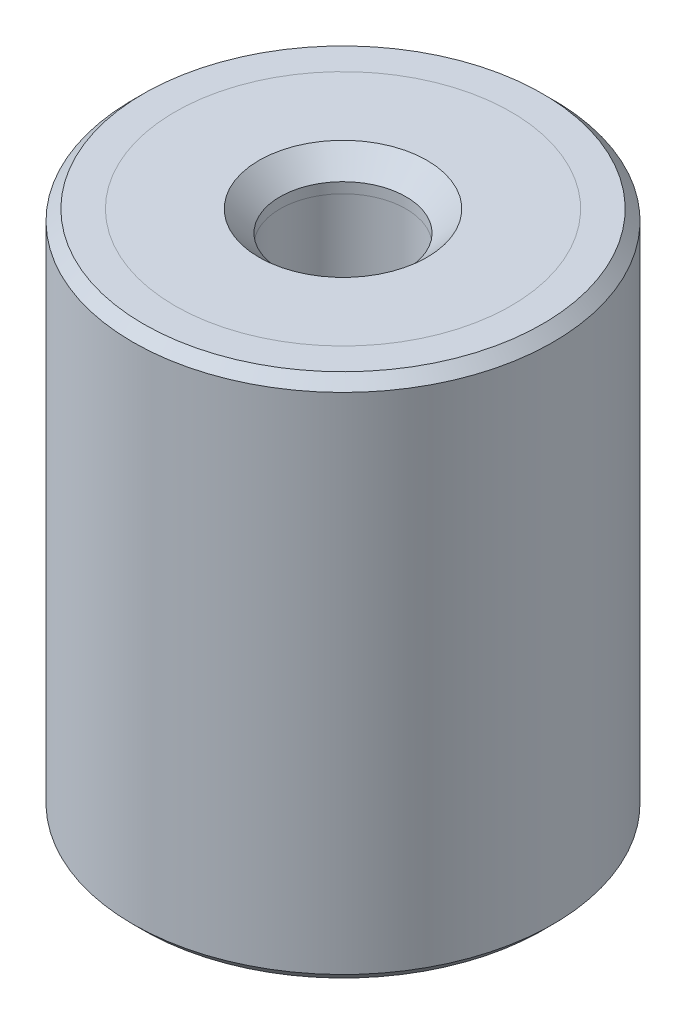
ISO-10303-21;
HEADER;
FILE_DESCRIPTION(('STEP AP214'),'2;1');
FILE_NAME('part.step','',(''),(''),'','','');
FILE_SCHEMA(('AUTOMOTIVE_DESIGN { 1 0 10303 214 1 1 1 1 }'));
ENDSEC;
DATA;
#1=APPLICATION_CONTEXT('core data for automotive mechanical design processes');
#2=APPLICATION_PROTOCOL_DEFINITION('international standard','automotive_design',2000,#1);
#3=PRODUCT_CONTEXT('',#1,'mechanical');
#4=PRODUCT('Part','Part','',(#3));
#5=PRODUCT_RELATED_PRODUCT_CATEGORY('part','',(#4));
#6=PRODUCT_DEFINITION_FORMATION('','',#4);
#7=PRODUCT_DEFINITION_CONTEXT('part definition',#1,'design');
#8=PRODUCT_DEFINITION('design','',#6,#7);
#9=PRODUCT_DEFINITION_SHAPE('','',#8);
#10=(LENGTH_UNIT() NAMED_UNIT(*) SI_UNIT(.MILLI.,.METRE.));
#11=(NAMED_UNIT(*) PLANE_ANGLE_UNIT() SI_UNIT($,.RADIAN.));
#12=(NAMED_UNIT(*) SI_UNIT($,.STERADIAN.) SOLID_ANGLE_UNIT());
#13=UNCERTAINTY_MEASURE_WITH_UNIT(LENGTH_MEASURE(1.E-05),#10,'distance_accuracy_value','');
#14=(GEOMETRIC_REPRESENTATION_CONTEXT(3) GLOBAL_UNCERTAINTY_ASSIGNED_CONTEXT((#13)) GLOBAL_UNIT_ASSIGNED_CONTEXT((#10,
#11,#12)) REPRESENTATION_CONTEXT('',''));
#15=CARTESIAN_POINT('',(0.,0.,0.));
#16=DIRECTION('',(0.,0.,1.));
#17=DIRECTION('',(1.,0.,0.));
#18=AXIS2_PLACEMENT_3D('',#15,#16,#17);
#19=CARTESIAN_POINT('',(0.,46.0340428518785,0.));
#20=DIRECTION('',(0.,1.,0.));
#21=DIRECTION('',(0.,0.,1.));
#22=AXIS2_PLACEMENT_3D('',#19,#20,#21);
#23=CYLINDRICAL_SURFACE('',#22,3.);
#24=CARTESIAN_POINT('',(0.,-22.5,0.));
#25=DIRECTION('',(0.,-1.,0.));
#26=DIRECTION('',(0.,0.,-1.));
#27=AXIS2_PLACEMENT_3D('',#24,#25,#26);
#28=CIRCLE('',#27,3.);
#29=CARTESIAN_POINT('',(0.,-22.5,-3.));
#30=VERTEX_POINT('',#29);
#31=EDGE_CURVE('P0_E10',#30,#30,#28,.T.);
#32=ORIENTED_EDGE('',*,*,#31,.T.);
#33=EDGE_LOOP('',(#32));
#34=FACE_BOUND('',#33,.T.);
#35=CARTESIAN_POINT('',(0.,-22.,0.));
#36=DIRECTION('',(0.,1.,0.));
#37=DIRECTION('',(0.,0.,1.));
#38=AXIS2_PLACEMENT_3D('',#35,#36,#37);
#39=CIRCLE('',#38,3.);
#40=CARTESIAN_POINT('',(0.,-22.,3.));
#41=VERTEX_POINT('',#40);
#42=EDGE_CURVE('P0_E25',#41,#41,#39,.T.);
#43=ORIENTED_EDGE('',*,*,#42,.T.);
#44=EDGE_LOOP('',(#43));
#45=FACE_BOUND('',#44,.T.);
#46=ADVANCED_FACE('P0_F14',(#34,#45),#23,.F.);
#47=CARTESIAN_POINT('',(0.,-22.,3.));
#48=DIRECTION('',(0.,1.,0.));
#49=DIRECTION('',(0.,0.,1.));
#50=AXIS2_PLACEMENT_3D('',#47,#48,#49);
#51=PLANE('',#50);
#52=CARTESIAN_POINT('',(0.,-22.,0.));
#53=DIRECTION('',(0.,1.,0.));
#54=DIRECTION('',(0.,0.,1.));
#55=AXIS2_PLACEMENT_3D('',#52,#53,#54);
#56=CIRCLE('',#55,8.);
#57=CARTESIAN_POINT('',(0.,-22.,8.));
#58=VERTEX_POINT('',#57);
#59=EDGE_CURVE('P0_E29',#58,#58,#56,.T.);
#60=ORIENTED_EDGE('',*,*,#59,.T.);
#61=EDGE_LOOP('',(#60));
#62=FACE_BOUND('',#61,.T.);
#63=ORIENTED_EDGE('',*,*,#42,.F.);
#64=EDGE_LOOP('',(#63));
#65=FACE_BOUND('',#64,.T.);
#66=ADVANCED_FACE('P0_F50',(#62,#65),#51,.T.);
#67=CARTESIAN_POINT('',(0.,46.0340428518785,0.));
#68=DIRECTION('',(0.,1.,0.));
#69=DIRECTION('',(0.,0.,1.));
#70=AXIS2_PLACEMENT_3D('',#67,#68,#69);
#71=CYLINDRICAL_SURFACE('',#70,8.);
#72=CARTESIAN_POINT('',(0.,-23.5,0.));
#73=DIRECTION('',(0.,1.,0.));
#74=DIRECTION('',(0.,0.,1.));
#75=AXIS2_PLACEMENT_3D('',#72,#73,#74);
#76=CIRCLE('',#75,8.);
#77=CARTESIAN_POINT('',(0.,-23.5,8.));
#78=VERTEX_POINT('',#77);
#79=EDGE_CURVE('P0_E34',#78,#78,#76,.T.);
#80=ORIENTED_EDGE('',*,*,#79,.T.);
#81=EDGE_LOOP('',(#80));
#82=FACE_BOUND('',#81,.T.);
#83=ORIENTED_EDGE('',*,*,#59,.F.);
#84=EDGE_LOOP('',(#83));
#85=FACE_BOUND('',#84,.T.);
#86=ADVANCED_FACE('P0_F38',(#82,#85),#71,.T.);
#87=CARTESIAN_POINT('',(0.,-23.5,8.));
#88=DIRECTION('',(0.,-1.,0.));
#89=DIRECTION('',(0.,0.,-1.));
#90=AXIS2_PLACEMENT_3D('',#87,#88,#89);
#91=PLANE('',#90);
#92=CARTESIAN_POINT('',(0.,-23.5,0.));
#93=DIRECTION('',(0.,-1.,0.));
#94=DIRECTION('',(0.,0.,-1.));
#95=AXIS2_PLACEMENT_3D('',#92,#93,#94);
#96=CIRCLE('',#95,4.);
#97=CARTESIAN_POINT('',(0.,-23.5,-4.));
#98=VERTEX_POINT('',#97);
#99=EDGE_CURVE('P0_E21',#98,#98,#96,.F.);
#100=ORIENTED_EDGE('',*,*,#99,.T.);
#101=EDGE_LOOP('',(#100));
#102=FACE_BOUND('',#101,.T.);
#103=ORIENTED_EDGE('',*,*,#79,.F.);
#104=EDGE_LOOP('',(#103));
#105=FACE_BOUND('',#104,.T.);
#106=ADVANCED_FACE('P0_F41',(#102,#105),#91,.T.);
#107=CARTESIAN_POINT('',(0.,-23.5,0.));
#108=DIRECTION('',(0.,-1.,0.));
#109=DIRECTION('',(0.,0.,-1.));
#110=AXIS2_PLACEMENT_3D('',#107,#108,#109);
#111=CONICAL_SURFACE('',#110,4.,0.785398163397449);
#112=ORIENTED_EDGE('',*,*,#31,.F.);
#113=EDGE_LOOP('',(#112));
#114=FACE_BOUND('',#113,.T.);
#115=ORIENTED_EDGE('',*,*,#99,.F.);
#116=EDGE_LOOP('',(#115));
#117=FACE_BOUND('',#116,.T.);
#118=ADVANCED_FACE('P0_F16',(#114,#117),#111,.F.);
#119=CLOSED_SHELL('',(#46,#66,#86,#106,#118));
#120=MANIFOLD_SOLID_BREP('P0_B1',#119);
#121=CARTESIAN_POINT('',(0.,69.5340428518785,0.));
#122=DIRECTION('',(0.,1.,0.));
#123=DIRECTION('',(0.,0.,1.));
#124=AXIS2_PLACEMENT_3D('',#121,#122,#123);
#125=CYLINDRICAL_SURFACE('',#124,3.);
#126=CARTESIAN_POINT('',(0.,0.5,0.));
#127=DIRECTION('',(0.,1.,0.));
#128=DIRECTION('',(0.,0.,1.));
#129=AXIS2_PLACEMENT_3D('',#126,#127,#128);
#130=CIRCLE('',#129,3.);
#131=CARTESIAN_POINT('',(0.,0.5,3.));
#132=VERTEX_POINT('',#131);
#133=EDGE_CURVE('P1_E21',#132,#132,#130,.T.);
#134=ORIENTED_EDGE('',*,*,#133,.T.);
#135=EDGE_LOOP('',(#134));
#136=FACE_BOUND('',#135,.T.);
#137=CARTESIAN_POINT('',(0.,0.,0.));
#138=DIRECTION('',(0.,1.,0.));
#139=DIRECTION('',(0.,0.,1.));
#140=AXIS2_PLACEMENT_3D('',#137,#138,#139);
#141=CIRCLE('',#140,3.);
#142=CARTESIAN_POINT('',(0.,0.,3.));
#143=VERTEX_POINT('',#142);
#144=EDGE_CURVE('P1_E34',#143,#143,#141,.T.);
#145=ORIENTED_EDGE('',*,*,#144,.F.);
#146=EDGE_LOOP('',(#145));
#147=FACE_BOUND('',#146,.T.);
#148=ADVANCED_FACE('P1_F14',(#136,#147),#125,.F.);
#149=CARTESIAN_POINT('',(0.,1.5,3.));
#150=DIRECTION('',(0.,1.,0.));
#151=DIRECTION('',(0.,0.,1.));
#152=AXIS2_PLACEMENT_3D('',#149,#150,#151);
#153=PLANE('',#152);
#154=CARTESIAN_POINT('',(0.,1.5,0.));
#155=DIRECTION('',(0.,1.,0.));
#156=DIRECTION('',(0.,0.,1.));
#157=AXIS2_PLACEMENT_3D('',#154,#155,#156);
#158=CIRCLE('',#157,4.);
#159=CARTESIAN_POINT('',(0.,1.5,4.));
#160=VERTEX_POINT('',#159);
#161=EDGE_CURVE('P1_E10',#160,#160,#158,.F.);
#162=ORIENTED_EDGE('',*,*,#161,.T.);
#163=EDGE_LOOP('',(#162));
#164=FACE_BOUND('',#163,.T.);
#165=CARTESIAN_POINT('',(0.,1.5,0.));
#166=DIRECTION('',(0.,1.,0.));
#167=DIRECTION('',(0.,0.,1.));
#168=AXIS2_PLACEMENT_3D('',#165,#166,#167);
#169=CIRCLE('',#168,8.);
#170=CARTESIAN_POINT('',(0.,1.5,8.));
#171=VERTEX_POINT('',#170);
#172=EDGE_CURVE('P1_E25',#171,#171,#169,.T.);
#173=ORIENTED_EDGE('',*,*,#172,.T.);
#174=EDGE_LOOP('',(#173));
#175=FACE_BOUND('',#174,.T.);
#176=ADVANCED_FACE('P1_F42',(#164,#175),#153,.T.);
#177=CARTESIAN_POINT('',(0.,69.5340428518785,0.));
#178=DIRECTION('',(0.,1.,0.));
#179=DIRECTION('',(0.,0.,1.));
#180=AXIS2_PLACEMENT_3D('',#177,#178,#179);
#181=CYLINDRICAL_SURFACE('',#180,8.);
#182=CARTESIAN_POINT('',(0.,0.,0.));
#183=DIRECTION('',(0.,1.,0.));
#184=DIRECTION('',(0.,0.,1.));
#185=AXIS2_PLACEMENT_3D('',#182,#183,#184);
#186=CIRCLE('',#185,8.);
#187=CARTESIAN_POINT('',(0.,0.,8.));
#188=VERTEX_POINT('',#187);
#189=EDGE_CURVE('P1_E29',#188,#188,#186,.T.);
#190=ORIENTED_EDGE('',*,*,#189,.T.);
#191=EDGE_LOOP('',(#190));
#192=FACE_BOUND('',#191,.T.);
#193=ORIENTED_EDGE('',*,*,#172,.F.);
#194=EDGE_LOOP('',(#193));
#195=FACE_BOUND('',#194,.T.);
#196=ADVANCED_FACE('P1_F47',(#192,#195),#181,.T.);
#197=CARTESIAN_POINT('',(0.,0.,8.));
#198=DIRECTION('',(0.,-1.,0.));
#199=DIRECTION('',(0.,0.,-1.));
#200=AXIS2_PLACEMENT_3D('',#197,#198,#199);
#201=PLANE('',#200);
#202=ORIENTED_EDGE('',*,*,#144,.T.);
#203=EDGE_LOOP('',(#202));
#204=FACE_BOUND('',#203,.T.);
#205=ORIENTED_EDGE('',*,*,#189,.F.);
#206=EDGE_LOOP('',(#205));
#207=FACE_BOUND('',#206,.T.);
#208=ADVANCED_FACE('P1_F38',(#204,#207),#201,.T.);
#209=CARTESIAN_POINT('',(0.,0.5,0.));
#210=DIRECTION('',(0.,1.,0.));
#211=DIRECTION('',(0.,0.,1.));
#212=AXIS2_PLACEMENT_3D('',#209,#210,#211);
#213=CONICAL_SURFACE('',#212,3.,0.78539816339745);
#214=ORIENTED_EDGE('',*,*,#161,.F.);
#215=EDGE_LOOP('',(#214));
#216=FACE_BOUND('',#215,.T.);
#217=ORIENTED_EDGE('',*,*,#133,.F.);
#218=EDGE_LOOP('',(#217));
#219=FACE_BOUND('',#218,.T.);
#220=ADVANCED_FACE('P1_F16',(#216,#219),#213,.F.);
#221=CLOSED_SHELL('',(#148,#176,#196,#208,#220));
#222=MANIFOLD_SOLID_BREP('P1_B1',#221);
#223=CARTESIAN_POINT('',(0.,0.,0.));
#224=DIRECTION('',(0.,1.,0.));
#225=DIRECTION('',(0.,0.,1.));
#226=AXIS2_PLACEMENT_3D('',#223,#224,#225);
#227=PLANE('',#226);
#228=CARTESIAN_POINT('',(0.,0.,0.));
#229=DIRECTION('',(0.,1.,0.));
#230=DIRECTION('',(0.,0.,1.));
#231=AXIS2_PLACEMENT_3D('',#228,#229,#230);
#232=CIRCLE('',#231,3.);
#233=CARTESIAN_POINT('',(0.,0.,3.));
#234=VERTEX_POINT('',#233);
#235=EDGE_CURVE('P2_E46',#234,#234,#232,.T.);
#236=ORIENTED_EDGE('',*,*,#235,.F.);
#237=EDGE_LOOP('',(#236));
#238=FACE_BOUND('',#237,.T.);
#239=CARTESIAN_POINT('',(0.,0.,0.));
#240=DIRECTION('',(0.,1.,0.));
#241=DIRECTION('',(0.,0.,1.));
#242=AXIS2_PLACEMENT_3D('',#239,#240,#241);
#243=CIRCLE('',#242,8.);
#244=CARTESIAN_POINT('',(0.,0.,8.));
#245=VERTEX_POINT('',#244);
#246=EDGE_CURVE('P2_E33',#245,#245,#243,.T.);
#247=ORIENTED_EDGE('',*,*,#246,.T.);
#248=EDGE_LOOP('',(#247));
#249=FACE_BOUND('',#248,.T.);
#250=ADVANCED_FACE('P2_F13',(#238,#249),#227,.T.);
#251=CARTESIAN_POINT('',(0.,65.5134936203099,0.));
#252=DIRECTION('',(0.,1.,0.));
#253=DIRECTION('',(0.,0.,1.));
#254=AXIS2_PLACEMENT_3D('',#251,#252,#253);
#255=CYLINDRICAL_SURFACE('',#254,8.);
#256=CARTESIAN_POINT('',(0.,1.5,0.));
#257=DIRECTION('',(0.,1.,0.));
#258=DIRECTION('',(0.,0.,1.));
#259=AXIS2_PLACEMENT_3D('',#256,#257,#258);
#260=CIRCLE('',#259,8.);
#261=CARTESIAN_POINT('',(0.,1.5,8.));
#262=VERTEX_POINT('',#261);
#263=EDGE_CURVE('P2_E36',#262,#262,#260,.T.);
#264=ORIENTED_EDGE('',*,*,#263,.T.);
#265=EDGE_LOOP('',(#264));
#266=FACE_BOUND('',#265,.T.);
#267=ORIENTED_EDGE('',*,*,#246,.F.);
#268=EDGE_LOOP('',(#267));
#269=FACE_BOUND('',#268,.T.);
#270=ADVANCED_FACE('P2_F92',(#266,#269),#255,.F.);
#271=CARTESIAN_POINT('',(0.,1.5,8.));
#272=DIRECTION('',(0.,1.,0.));
#273=DIRECTION('',(0.,0.,1.));
#274=AXIS2_PLACEMENT_3D('',#271,#272,#273);
#275=PLANE('',#274);
#276=CARTESIAN_POINT('',(0.,1.5,0.));
#277=DIRECTION('',(0.,1.,0.));
#278=DIRECTION('',(0.,0.,1.));
#279=AXIS2_PLACEMENT_3D('',#276,#277,#278);
#280=CIRCLE('',#279,9.5);
#281=CARTESIAN_POINT('',(0.,1.5,9.5));
#282=VERTEX_POINT('',#281);
#283=EDGE_CURVE('P2_E9',#282,#282,#280,.T.);
#284=ORIENTED_EDGE('',*,*,#283,.T.);
#285=EDGE_LOOP('',(#284));
#286=FACE_BOUND('',#285,.T.);
#287=ORIENTED_EDGE('',*,*,#263,.F.);
#288=EDGE_LOOP('',(#287));
#289=FACE_BOUND('',#288,.T.);
#290=ADVANCED_FACE('P2_F88',(#286,#289),#275,.T.);
#291=CARTESIAN_POINT('',(0.,65.5134936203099,0.));
#292=DIRECTION('',(0.,1.,0.));
#293=DIRECTION('',(0.,0.,1.));
#294=AXIS2_PLACEMENT_3D('',#291,#292,#293);
#295=CYLINDRICAL_SURFACE('',#294,10.);
#296=CARTESIAN_POINT('',(0.,-23.,0.));
#297=DIRECTION('',(0.,-1.,0.));
#298=DIRECTION('',(0.,0.,-1.));
#299=AXIS2_PLACEMENT_3D('',#296,#297,#298);
#300=CIRCLE('',#299,10.);
#301=CARTESIAN_POINT('',(0.,-23.,-10.));
#302=VERTEX_POINT('',#301);
#303=EDGE_CURVE('P2_E24',#302,#302,#300,.F.);
#304=ORIENTED_EDGE('',*,*,#303,.T.);
#305=EDGE_LOOP('',(#304));
#306=FACE_BOUND('',#305,.T.);
#307=CARTESIAN_POINT('',(0.,1.,0.));
#308=DIRECTION('',(0.,1.,0.));
#309=DIRECTION('',(0.,0.,1.));
#310=AXIS2_PLACEMENT_3D('',#307,#308,#309);
#311=CIRCLE('',#310,10.);
#312=CARTESIAN_POINT('',(0.,1.,10.));
#313=VERTEX_POINT('',#312);
#314=EDGE_CURVE('P2_E28',#313,#313,#311,.F.);
#315=ORIENTED_EDGE('',*,*,#314,.T.);
#316=EDGE_LOOP('',(#315));
#317=FACE_BOUND('',#316,.T.);
#318=ADVANCED_FACE('P2_F82',(#306,#317),#295,.T.);
#319=CARTESIAN_POINT('',(0.,-23.5,9.99999999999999));
#320=DIRECTION('',(0.,-1.,0.));
#321=DIRECTION('',(0.,0.,-1.));
#322=AXIS2_PLACEMENT_3D('',#319,#320,#321);
#323=PLANE('',#322);
#324=CARTESIAN_POINT('',(0.,-23.5,0.));
#325=DIRECTION('',(0.,-1.,0.));
#326=DIRECTION('',(0.,0.,-1.));
#327=AXIS2_PLACEMENT_3D('',#324,#325,#326);
#328=CIRCLE('',#327,9.5);
#329=CARTESIAN_POINT('',(0.,-23.5,-9.5));
#330=VERTEX_POINT('',#329);
#331=EDGE_CURVE('P2_E20',#330,#330,#328,.T.);
#332=ORIENTED_EDGE('',*,*,#331,.T.);
#333=EDGE_LOOP('',(#332));
#334=FACE_BOUND('',#333,.T.);
#335=CARTESIAN_POINT('',(0.,-23.5,0.));
#336=DIRECTION('',(0.,1.,0.));
#337=DIRECTION('',(0.,0.,1.));
#338=AXIS2_PLACEMENT_3D('',#335,#336,#337);
#339=CIRCLE('',#338,8.);
#340=CARTESIAN_POINT('',(0.,-23.5,8.));
#341=VERTEX_POINT('',#340);
#342=EDGE_CURVE('P2_E39',#341,#341,#339,.T.);
#343=ORIENTED_EDGE('',*,*,#342,.T.);
#344=EDGE_LOOP('',(#343));
#345=FACE_BOUND('',#344,.T.);
#346=ADVANCED_FACE('P2_F77',(#334,#345),#323,.T.);
#347=CARTESIAN_POINT('',(0.,65.5134936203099,0.));
#348=DIRECTION('',(0.,1.,0.));
#349=DIRECTION('',(0.,0.,1.));
#350=AXIS2_PLACEMENT_3D('',#347,#348,#349);
#351=CYLINDRICAL_SURFACE('',#350,8.);
#352=CARTESIAN_POINT('',(0.,-22.,0.));
#353=DIRECTION('',(0.,1.,0.));
#354=DIRECTION('',(0.,0.,1.));
#355=AXIS2_PLACEMENT_3D('',#352,#353,#354);
#356=CIRCLE('',#355,8.);
#357=CARTESIAN_POINT('',(0.,-22.,8.));
#358=VERTEX_POINT('',#357);
#359=EDGE_CURVE('P2_E42',#358,#358,#356,.T.);
#360=ORIENTED_EDGE('',*,*,#359,.T.);
#361=EDGE_LOOP('',(#360));
#362=FACE_BOUND('',#361,.T.);
#363=ORIENTED_EDGE('',*,*,#342,.F.);
#364=EDGE_LOOP('',(#363));
#365=FACE_BOUND('',#364,.T.);
#366=ADVANCED_FACE('P2_F71',(#362,#365),#351,.F.);
#367=CARTESIAN_POINT('',(0.,-22.,8.));
#368=DIRECTION('',(0.,-1.,0.));
#369=DIRECTION('',(0.,0.,-1.));
#370=AXIS2_PLACEMENT_3D('',#367,#368,#369);
#371=PLANE('',#370);
#372=CARTESIAN_POINT('',(0.,-22.,0.));
#373=DIRECTION('',(0.,-1.,0.));
#374=DIRECTION('',(0.,0.,-1.));
#375=AXIS2_PLACEMENT_3D('',#372,#373,#374);
#376=CIRCLE('',#375,3.);
#377=CARTESIAN_POINT('',(0.,-22.,-3.));
#378=VERTEX_POINT('',#377);
#379=EDGE_CURVE('P2_E52',#378,#378,#376,.T.);
#380=ORIENTED_EDGE('',*,*,#379,.F.);
#381=EDGE_LOOP('',(#380));
#382=FACE_BOUND('',#381,.T.);
#383=ORIENTED_EDGE('',*,*,#359,.F.);
#384=EDGE_LOOP('',(#383));
#385=FACE_BOUND('',#384,.T.);
#386=ADVANCED_FACE('P2_F67',(#382,#385),#371,.T.);
#387=CARTESIAN_POINT('',(0.,-23.,0.));
#388=DIRECTION('',(0.,1.,0.));
#389=DIRECTION('',(0.,0.,1.));
#390=AXIS2_PLACEMENT_3D('',#387,#388,#389);
#391=CONICAL_SURFACE('',#390,10.,0.785398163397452);
#392=ORIENTED_EDGE('',*,*,#331,.F.);
#393=EDGE_LOOP('',(#392));
#394=FACE_BOUND('',#393,.T.);
#395=ORIENTED_EDGE('',*,*,#303,.F.);
#396=EDGE_LOOP('',(#395));
#397=FACE_BOUND('',#396,.T.);
#398=ADVANCED_FACE('P2_F70',(#394,#397),#391,.T.);
#399=CARTESIAN_POINT('',(0.,1.5,0.));
#400=DIRECTION('',(0.,-1.,0.));
#401=DIRECTION('',(0.,0.,-1.));
#402=AXIS2_PLACEMENT_3D('',#399,#400,#401);
#403=CONICAL_SURFACE('',#402,9.5,0.785398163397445);
#404=ORIENTED_EDGE('',*,*,#314,.F.);
#405=EDGE_LOOP('',(#404));
#406=FACE_BOUND('',#405,.T.);
#407=ORIENTED_EDGE('',*,*,#283,.F.);
#408=EDGE_LOOP('',(#407));
#409=FACE_BOUND('',#408,.T.);
#410=ADVANCED_FACE('P2_F15',(#406,#409),#403,.T.);
#411=CARTESIAN_POINT('',(0.,-4.5,0.));
#412=DIRECTION('',(0.,1.,0.));
#413=DIRECTION('',(0.,0.,1.));
#414=AXIS2_PLACEMENT_3D('',#411,#412,#413);
#415=CYLINDRICAL_SURFACE('',#414,3.);
#416=CARTESIAN_POINT('',(0.,-4.5,0.));
#417=DIRECTION('',(0.,1.,0.));
#418=DIRECTION('',(0.,0.,1.));
#419=AXIS2_PLACEMENT_3D('',#416,#417,#418);
#420=CIRCLE('',#419,3.);
#421=CARTESIAN_POINT('',(0.,-4.5,3.));
#422=VERTEX_POINT('',#421);
#423=EDGE_CURVE('P2_E45',#422,#422,#420,.T.);
#424=ORIENTED_EDGE('',*,*,#423,.F.);
#425=EDGE_LOOP('',(#424));
#426=FACE_BOUND('',#425,.T.);
#427=ORIENTED_EDGE('',*,*,#235,.T.);
#428=EDGE_LOOP('',(#427));
#429=FACE_BOUND('',#428,.T.);
#430=ADVANCED_FACE('P2_F108',(#426,#429),#415,.F.);
#431=CARTESIAN_POINT('',(0.,-4.5,0.));
#432=DIRECTION('',(0.,1.,0.));
#433=DIRECTION('',(0.,0.,1.));
#434=AXIS2_PLACEMENT_3D('',#431,#432,#433);
#435=PLANE('',#434);
#436=ORIENTED_EDGE('',*,*,#423,.T.);
#437=EDGE_LOOP('',(#436));
#438=FACE_BOUND('',#437,.T.);
#439=ADVANCED_FACE('P2_F63',(#438),#435,.T.);
#440=CARTESIAN_POINT('',(0.,-17.5,0.));
#441=DIRECTION('',(0.,-1.,0.));
#442=DIRECTION('',(0.,0.,-1.));
#443=AXIS2_PLACEMENT_3D('',#440,#441,#442);
#444=CYLINDRICAL_SURFACE('',#443,3.);
#445=CARTESIAN_POINT('',(0.,-17.5,0.));
#446=DIRECTION('',(0.,-1.,0.));
#447=DIRECTION('',(0.,0.,-1.));
#448=AXIS2_PLACEMENT_3D('',#445,#446,#447);
#449=CIRCLE('',#448,3.);
#450=CARTESIAN_POINT('',(0.,-17.5,-3.));
#451=VERTEX_POINT('',#450);
#452=EDGE_CURVE('P2_E49',#451,#451,#449,.T.);
#453=ORIENTED_EDGE('',*,*,#452,.F.);
#454=EDGE_LOOP('',(#453));
#455=FACE_BOUND('',#454,.T.);
#456=ORIENTED_EDGE('',*,*,#379,.T.);
#457=EDGE_LOOP('',(#456));
#458=FACE_BOUND('',#457,.T.);
#459=ADVANCED_FACE('P2_F60',(#455,#458),#444,.F.);
#460=CARTESIAN_POINT('',(0.,-17.5,0.));
#461=DIRECTION('',(0.,-1.,0.));
#462=DIRECTION('',(0.,0.,-1.));
#463=AXIS2_PLACEMENT_3D('',#460,#461,#462);
#464=PLANE('',#463);
#465=ORIENTED_EDGE('',*,*,#452,.T.);
#466=EDGE_LOOP('',(#465));
#467=FACE_BOUND('',#466,.T.);
#468=ADVANCED_FACE('P2_F58',(#467),#464,.T.);
#469=CLOSED_SHELL('',(#250,#270,#290,#318,#346,#366,#386,#398,#410,#430,#439,#459,#468));
#470=MANIFOLD_SOLID_BREP('P2_B1',#469);
#471=ADVANCED_BREP_SHAPE_REPRESENTATION('',(#18,#120,#222,#470),#14);
#472=SHAPE_DEFINITION_REPRESENTATION(#9,#471);
ENDSEC;
END-ISO-10303-21;
